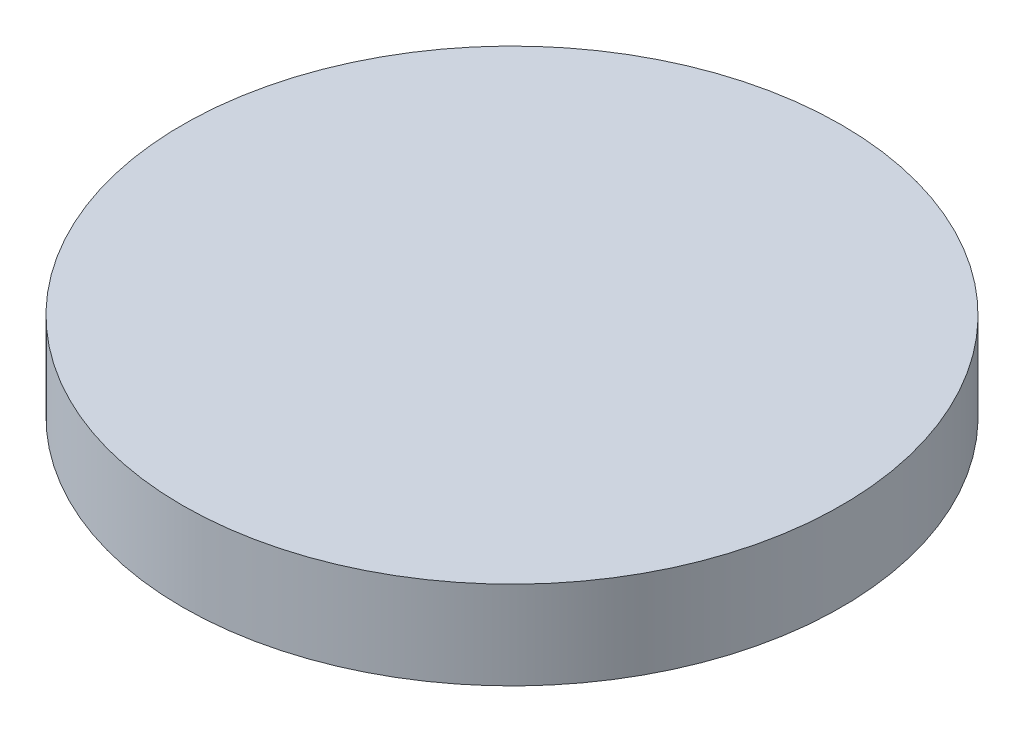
ISO-10303-21;
HEADER;
FILE_DESCRIPTION(('STEP AP214'),'2;1');
FILE_NAME('part.step','',(''),(''),'','','');
FILE_SCHEMA(('AUTOMOTIVE_DESIGN { 1 0 10303 214 1 1 1 1 }'));
ENDSEC;
DATA;
#1=APPLICATION_CONTEXT('core data for automotive mechanical design processes');
#2=APPLICATION_PROTOCOL_DEFINITION('international standard','automotive_design',2000,#1);
#3=PRODUCT_CONTEXT('',#1,'mechanical');
#4=PRODUCT('Part','Part','',(#3));
#5=PRODUCT_RELATED_PRODUCT_CATEGORY('part','',(#4));
#6=PRODUCT_DEFINITION_FORMATION('','',#4);
#7=PRODUCT_DEFINITION_CONTEXT('part definition',#1,'design');
#8=PRODUCT_DEFINITION('design','',#6,#7);
#9=PRODUCT_DEFINITION_SHAPE('','',#8);
#10=(LENGTH_UNIT() NAMED_UNIT(*) SI_UNIT(.MILLI.,.METRE.));
#11=(NAMED_UNIT(*) PLANE_ANGLE_UNIT() SI_UNIT($,.RADIAN.));
#12=(NAMED_UNIT(*) SI_UNIT($,.STERADIAN.) SOLID_ANGLE_UNIT());
#13=UNCERTAINTY_MEASURE_WITH_UNIT(LENGTH_MEASURE(1.E-05),#10,'distance_accuracy_value','');
#14=(GEOMETRIC_REPRESENTATION_CONTEXT(3) GLOBAL_UNCERTAINTY_ASSIGNED_CONTEXT((#13)) GLOBAL_UNIT_ASSIGNED_CONTEXT((#10,
#11,#12)) REPRESENTATION_CONTEXT('',''));
#15=CARTESIAN_POINT('',(0.,0.,0.));
#16=DIRECTION('',(0.,0.,1.));
#17=DIRECTION('',(1.,0.,0.));
#18=AXIS2_PLACEMENT_3D('',#15,#16,#17);
#19=CARTESIAN_POINT('',(0.,1.27,0.));
#20=DIRECTION('',(0.,-1.,0.));
#21=DIRECTION('',(0.,0.,-1.));
#22=AXIS2_PLACEMENT_3D('',#19,#20,#21);
#23=CYLINDRICAL_SURFACE('',#22,9.5);
#24=CARTESIAN_POINT('',(0.,1.27,0.));
#25=DIRECTION('',(0.,1.,0.));
#26=DIRECTION('',(0.,0.,1.));
#27=AXIS2_PLACEMENT_3D('',#24,#25,#26);
#28=CIRCLE('',#27,9.5);
#29=CARTESIAN_POINT('',(0.,1.27,9.5));
#30=VERTEX_POINT('',#29);
#31=EDGE_CURVE('E10',#30,#30,#28,.T.);
#32=ORIENTED_EDGE('',*,*,#31,.F.);
#33=EDGE_LOOP('',(#32));
#34=FACE_BOUND('',#33,.T.);
#35=CARTESIAN_POINT('',(0.,-1.27,0.));
#36=DIRECTION('',(0.,1.,0.));
#37=DIRECTION('',(0.,0.,1.));
#38=AXIS2_PLACEMENT_3D('',#35,#36,#37);
#39=CIRCLE('',#38,9.5);
#40=CARTESIAN_POINT('',(0.,-1.27,9.5));
#41=VERTEX_POINT('',#40);
#42=EDGE_CURVE('E34',#41,#41,#39,.T.);
#43=ORIENTED_EDGE('',*,*,#42,.T.);
#44=EDGE_LOOP('',(#43));
#45=FACE_BOUND('',#44,.T.);
#46=ADVANCED_FACE('F31',(#34,#45),#23,.T.);
#47=CARTESIAN_POINT('',(0.,1.27,0.));
#48=DIRECTION('',(0.,1.,0.));
#49=DIRECTION('',(0.,0.,1.));
#50=AXIS2_PLACEMENT_3D('',#47,#48,#49);
#51=PLANE('',#50);
#52=ORIENTED_EDGE('',*,*,#31,.T.);
#53=EDGE_LOOP('',(#52));
#54=FACE_BOUND('',#53,.T.);
#55=ADVANCED_FACE('F46',(#54),#51,.T.);
#56=CARTESIAN_POINT('',(0.,-1.27,0.));
#57=DIRECTION('',(0.,1.,0.));
#58=DIRECTION('',(0.,0.,1.));
#59=AXIS2_PLACEMENT_3D('',#56,#57,#58);
#60=PLANE('',#59);
#61=ORIENTED_EDGE('',*,*,#42,.F.);
#62=EDGE_LOOP('',(#61));
#63=FACE_BOUND('',#62,.T.);
#64=ADVANCED_FACE('F44',(#63),#60,.F.);
#65=CLOSED_SHELL('',(#46,#55,#64));
#66=MANIFOLD_SOLID_BREP('B2',#65);
#67=ADVANCED_BREP_SHAPE_REPRESENTATION('',(#18,#66),#14);
#68=SHAPE_DEFINITION_REPRESENTATION(#9,#67);
ENDSEC;
END-ISO-10303-21;
